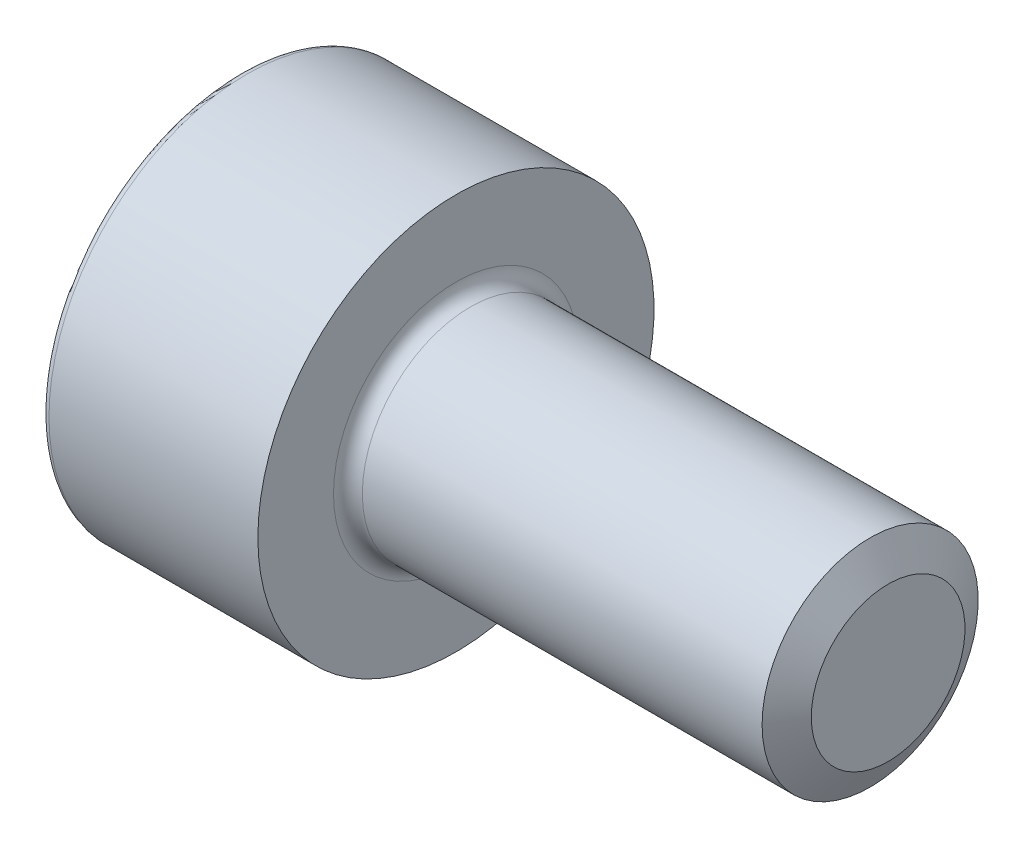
ISO-10303-21;
HEADER;
FILE_DESCRIPTION(('STEP AP214'),'2;1');
FILE_NAME('part.step','',(''),(''),'','','');
FILE_SCHEMA(('AUTOMOTIVE_DESIGN { 1 0 10303 214 1 1 1 1 }'));
ENDSEC;
DATA;
#1=APPLICATION_CONTEXT('core data for automotive mechanical design processes');
#2=APPLICATION_PROTOCOL_DEFINITION('international standard','automotive_design',2000,#1);
#3=PRODUCT_CONTEXT('',#1,'mechanical');
#4=PRODUCT('Part','Part','',(#3));
#5=PRODUCT_RELATED_PRODUCT_CATEGORY('part','',(#4));
#6=PRODUCT_DEFINITION_FORMATION('','',#4);
#7=PRODUCT_DEFINITION_CONTEXT('part definition',#1,'design');
#8=PRODUCT_DEFINITION('design','',#6,#7);
#9=PRODUCT_DEFINITION_SHAPE('','',#8);
#10=(LENGTH_UNIT() NAMED_UNIT(*) SI_UNIT(.MILLI.,.METRE.));
#11=(NAMED_UNIT(*) PLANE_ANGLE_UNIT() SI_UNIT($,.RADIAN.));
#12=(NAMED_UNIT(*) SI_UNIT($,.STERADIAN.) SOLID_ANGLE_UNIT());
#13=UNCERTAINTY_MEASURE_WITH_UNIT(LENGTH_MEASURE(1.E-05),#10,'distance_accuracy_value','');
#14=(GEOMETRIC_REPRESENTATION_CONTEXT(3) GLOBAL_UNCERTAINTY_ASSIGNED_CONTEXT((#13)) GLOBAL_UNIT_ASSIGNED_CONTEXT((#10,
#11,#12)) REPRESENTATION_CONTEXT('',''));
#15=CARTESIAN_POINT('',(0.,0.,0.));
#16=DIRECTION('',(0.,0.,1.));
#17=DIRECTION('',(1.,0.,0.));
#18=AXIS2_PLACEMENT_3D('',#15,#16,#17);
#19=CARTESIAN_POINT('',(9.,1.5,0.));
#20=DIRECTION('',(-1.,0.,0.));
#21=DIRECTION('',(0.,0.,1.));
#22=AXIS2_PLACEMENT_3D('',#19,#20,#21);
#23=PLANE('',#22);
#24=CARTESIAN_POINT('',(9.,0.,0.));
#25=DIRECTION('',(-1.,0.,0.));
#26=DIRECTION('',(0.,0.,1.));
#27=AXIS2_PLACEMENT_3D('',#24,#25,#26);
#28=CIRCLE('',#27,1.067);
#29=CARTESIAN_POINT('',(9.,0.,1.067));
#30=VERTEX_POINT('',#29);
#31=EDGE_CURVE('E184',#30,#30,#28,.T.);
#32=ORIENTED_EDGE('',*,*,#31,.F.);
#33=EDGE_LOOP('',(#32));
#34=FACE_BOUND('',#33,.T.);
#35=ADVANCED_FACE('F17',(#34),#23,.F.);
#36=CARTESIAN_POINT('',(1.3,-1.24274645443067,0.7175));
#37=DIRECTION('',(1.,0.,0.));
#38=DIRECTION('',(0.,1.,0.));
#39=AXIS2_PLACEMENT_3D('',#36,#37,#38);
#40=PLANE('',#39);
#41=DIRECTION('',(0.,0.866025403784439,0.5));
#42=VECTOR('',#41,1.);
#43=CARTESIAN_POINT('',(1.3,-1.24274645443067,0.7175));
#44=LINE('',#43,#42);
#45=CARTESIAN_POINT('',(1.3,-1.24274645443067,0.7175));
#46=VERTEX_POINT('',#45);
#47=CARTESIAN_POINT('',(1.3,0.,1.435));
#48=VERTEX_POINT('',#47);
#49=EDGE_CURVE('E96',#46,#48,#44,.T.);
#50=ORIENTED_EDGE('',*,*,#49,.T.);
#51=DIRECTION('',(0.,0.866025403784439,-0.5));
#52=VECTOR('',#51,1.);
#53=CARTESIAN_POINT('',(1.3,0.,1.435));
#54=LINE('',#53,#52);
#55=CARTESIAN_POINT('',(1.3,1.24274645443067,0.7175));
#56=VERTEX_POINT('',#55);
#57=EDGE_CURVE('E11',#48,#56,#54,.T.);
#58=ORIENTED_EDGE('',*,*,#57,.T.);
#59=DIRECTION('',(0.,0.,-1.));
#60=VECTOR('',#59,1.);
#61=CARTESIAN_POINT('',(1.3,1.24274645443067,0.7175));
#62=LINE('',#61,#60);
#63=CARTESIAN_POINT('',(1.3,1.24274645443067,-0.7175));
#64=VERTEX_POINT('',#63);
#65=EDGE_CURVE('E44',#56,#64,#62,.T.);
#66=ORIENTED_EDGE('',*,*,#65,.T.);
#67=DIRECTION('',(0.,-0.866025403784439,-0.5));
#68=VECTOR('',#67,1.);
#69=CARTESIAN_POINT('',(1.3,1.24274645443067,-0.7175));
#70=LINE('',#69,#68);
#71=CARTESIAN_POINT('',(1.3,0.,-1.435));
#72=VERTEX_POINT('',#71);
#73=EDGE_CURVE('E134',#64,#72,#70,.T.);
#74=ORIENTED_EDGE('',*,*,#73,.T.);
#75=DIRECTION('',(0.,-0.866025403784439,0.5));
#76=VECTOR('',#75,1.);
#77=CARTESIAN_POINT('',(1.3,0.,-1.435));
#78=LINE('',#77,#76);
#79=CARTESIAN_POINT('',(1.3,-1.24274645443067,-0.7175));
#80=VERTEX_POINT('',#79);
#81=EDGE_CURVE('E154',#72,#80,#78,.T.);
#82=ORIENTED_EDGE('',*,*,#81,.T.);
#83=DIRECTION('',(0.,0.,1.));
#84=VECTOR('',#83,1.);
#85=CARTESIAN_POINT('',(1.3,-1.24274645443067,-0.7175));
#86=LINE('',#85,#84);
#87=EDGE_CURVE('E146',#80,#46,#86,.T.);
#88=ORIENTED_EDGE('',*,*,#87,.T.);
#89=EDGE_LOOP('',(#50,#58,#66,#74,#82,#88));
#90=FACE_BOUND('',#89,.T.);
#91=ADVANCED_FACE('F221',(#90),#40,.F.);
#92=CARTESIAN_POINT('',(1.3,0.,1.435));
#93=DIRECTION('',(0.,0.5,0.866025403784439));
#94=DIRECTION('',(1.,0.,0.));
#95=AXIS2_PLACEMENT_3D('',#92,#93,#94);
#96=PLANE('',#95);
#97=DIRECTION('',(0.,0.866025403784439,-0.5));
#98=VECTOR('',#97,1.);
#99=CARTESIAN_POINT('',(0.,0.,1.435));
#100=LINE('',#99,#98);
#101=CARTESIAN_POINT('',(0.,0.,1.435));
#102=VERTEX_POINT('',#101);
#103=CARTESIAN_POINT('',(0.,1.24274645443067,0.7175));
#104=VERTEX_POINT('',#103);
#105=EDGE_CURVE('E92',#102,#104,#100,.T.);
#106=ORIENTED_EDGE('',*,*,#105,.T.);
#107=DIRECTION('',(-1.,0.,0.));
#108=VECTOR('',#107,1.);
#109=CARTESIAN_POINT('',(1.3,1.24274645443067,0.7175));
#110=LINE('',#109,#108);
#111=EDGE_CURVE('E25',#56,#104,#110,.T.);
#112=ORIENTED_EDGE('',*,*,#111,.F.);
#113=ORIENTED_EDGE('',*,*,#57,.F.);
#114=DIRECTION('',(-1.,0.,0.));
#115=VECTOR('',#114,1.);
#116=CARTESIAN_POINT('',(1.3,0.,1.435));
#117=LINE('',#116,#115);
#118=EDGE_CURVE('E88',#48,#102,#117,.T.);
#119=ORIENTED_EDGE('',*,*,#118,.T.);
#120=EDGE_LOOP('',(#106,#112,#113,#119));
#121=FACE_BOUND('',#120,.T.);
#122=ADVANCED_FACE('F90',(#121),#96,.F.);
#123=CARTESIAN_POINT('',(1.3,1.24274645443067,0.7175));
#124=DIRECTION('',(0.,1.,0.));
#125=DIRECTION('',(1.,0.,0.));
#126=AXIS2_PLACEMENT_3D('',#123,#124,#125);
#127=PLANE('',#126);
#128=DIRECTION('',(0.,0.,-1.));
#129=VECTOR('',#128,1.);
#130=CARTESIAN_POINT('',(0.,1.24274645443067,0.7175));
#131=LINE('',#130,#129);
#132=CARTESIAN_POINT('',(0.,1.24274645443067,-0.7175));
#133=VERTEX_POINT('',#132);
#134=EDGE_CURVE('E97',#104,#133,#131,.T.);
#135=ORIENTED_EDGE('',*,*,#134,.T.);
#136=DIRECTION('',(-1.,0.,0.));
#137=VECTOR('',#136,1.);
#138=CARTESIAN_POINT('',(1.3,1.24274645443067,-0.7175));
#139=LINE('',#138,#137);
#140=EDGE_CURVE('E137',#64,#133,#139,.T.);
#141=ORIENTED_EDGE('',*,*,#140,.F.);
#142=ORIENTED_EDGE('',*,*,#65,.F.);
#143=ORIENTED_EDGE('',*,*,#111,.T.);
#144=EDGE_LOOP('',(#135,#141,#142,#143));
#145=FACE_BOUND('',#144,.T.);
#146=ADVANCED_FACE('F231',(#145),#127,.F.);
#147=CARTESIAN_POINT('',(1.3,1.24274645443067,-0.7175));
#148=DIRECTION('',(0.,0.5,-0.866025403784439));
#149=DIRECTION('',(-1.,0.,0.));
#150=AXIS2_PLACEMENT_3D('',#147,#148,#149);
#151=PLANE('',#150);
#152=DIRECTION('',(0.,-0.866025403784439,-0.5));
#153=VECTOR('',#152,1.);
#154=CARTESIAN_POINT('',(0.,1.24274645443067,-0.7175));
#155=LINE('',#154,#153);
#156=CARTESIAN_POINT('',(0.,0.,-1.435));
#157=VERTEX_POINT('',#156);
#158=EDGE_CURVE('E133',#133,#157,#155,.T.);
#159=ORIENTED_EDGE('',*,*,#158,.T.);
#160=DIRECTION('',(-1.,0.,0.));
#161=VECTOR('',#160,1.);
#162=CARTESIAN_POINT('',(1.3,0.,-1.435));
#163=LINE('',#162,#161);
#164=EDGE_CURVE('E138',#72,#157,#163,.T.);
#165=ORIENTED_EDGE('',*,*,#164,.F.);
#166=ORIENTED_EDGE('',*,*,#73,.F.);
#167=ORIENTED_EDGE('',*,*,#140,.T.);
#168=EDGE_LOOP('',(#159,#165,#166,#167));
#169=FACE_BOUND('',#168,.T.);
#170=ADVANCED_FACE('F235',(#169),#151,.F.);
#171=CARTESIAN_POINT('',(1.3,0.,-1.435));
#172=DIRECTION('',(0.,-0.5,-0.866025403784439));
#173=DIRECTION('',(0.,-0.866025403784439,0.5));
#174=AXIS2_PLACEMENT_3D('',#171,#172,#173);
#175=PLANE('',#174);
#176=DIRECTION('',(0.,-0.866025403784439,0.5));
#177=VECTOR('',#176,1.);
#178=CARTESIAN_POINT('',(0.,0.,-1.435));
#179=LINE('',#178,#177);
#180=CARTESIAN_POINT('',(0.,-1.24274645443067,-0.7175));
#181=VERTEX_POINT('',#180);
#182=EDGE_CURVE('E129',#157,#181,#179,.T.);
#183=ORIENTED_EDGE('',*,*,#182,.T.);
#184=DIRECTION('',(-1.,0.,0.));
#185=VECTOR('',#184,1.);
#186=CARTESIAN_POINT('',(1.3,-1.24274645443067,-0.7175));
#187=LINE('',#186,#185);
#188=EDGE_CURVE('E151',#80,#181,#187,.T.);
#189=ORIENTED_EDGE('',*,*,#188,.F.);
#190=ORIENTED_EDGE('',*,*,#81,.F.);
#191=ORIENTED_EDGE('',*,*,#164,.T.);
#192=EDGE_LOOP('',(#183,#189,#190,#191));
#193=FACE_BOUND('',#192,.T.);
#194=ADVANCED_FACE('F239',(#193),#175,.F.);
#195=CARTESIAN_POINT('',(1.3,-1.24274645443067,-0.7175));
#196=DIRECTION('',(0.,-1.,0.));
#197=DIRECTION('',(0.,0.,-1.));
#198=AXIS2_PLACEMENT_3D('',#195,#196,#197);
#199=PLANE('',#198);
#200=DIRECTION('',(0.,0.,1.));
#201=VECTOR('',#200,1.);
#202=CARTESIAN_POINT('',(0.,-1.24274645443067,-0.7175));
#203=LINE('',#202,#201);
#204=CARTESIAN_POINT('',(0.,-1.24274645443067,0.7175));
#205=VERTEX_POINT('',#204);
#206=EDGE_CURVE('E108',#181,#205,#203,.T.);
#207=ORIENTED_EDGE('',*,*,#206,.T.);
#208=DIRECTION('',(-1.,0.,0.));
#209=VECTOR('',#208,1.);
#210=CARTESIAN_POINT('',(1.3,-1.24274645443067,0.7175));
#211=LINE('',#210,#209);
#212=EDGE_CURVE('E103',#46,#205,#211,.T.);
#213=ORIENTED_EDGE('',*,*,#212,.F.);
#214=ORIENTED_EDGE('',*,*,#87,.F.);
#215=ORIENTED_EDGE('',*,*,#188,.T.);
#216=EDGE_LOOP('',(#207,#213,#214,#215));
#217=FACE_BOUND('',#216,.T.);
#218=ADVANCED_FACE('F243',(#217),#199,.F.);
#219=CARTESIAN_POINT('',(1.3,-1.24274645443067,0.7175));
#220=DIRECTION('',(0.,-0.5,0.866025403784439));
#221=DIRECTION('',(-1.,0.,0.));
#222=AXIS2_PLACEMENT_3D('',#219,#220,#221);
#223=PLANE('',#222);
#224=DIRECTION('',(0.,0.866025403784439,0.5));
#225=VECTOR('',#224,1.);
#226=CARTESIAN_POINT('',(0.,-1.24274645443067,0.7175));
#227=LINE('',#226,#225);
#228=EDGE_CURVE('E100',#205,#102,#227,.T.);
#229=ORIENTED_EDGE('',*,*,#228,.T.);
#230=ORIENTED_EDGE('',*,*,#118,.F.);
#231=ORIENTED_EDGE('',*,*,#49,.F.);
#232=ORIENTED_EDGE('',*,*,#212,.T.);
#233=EDGE_LOOP('',(#229,#230,#231,#232));
#234=FACE_BOUND('',#233,.T.);
#235=ADVANCED_FACE('F101',(#234),#223,.F.);
#236=CARTESIAN_POINT('',(3.,2.75,0.));
#237=DIRECTION('',(-1.,0.,0.));
#238=DIRECTION('',(0.,0.,1.));
#239=AXIS2_PLACEMENT_3D('',#236,#237,#238);
#240=PLANE('',#239);
#241=CARTESIAN_POINT('',(3.,0.,0.));
#242=DIRECTION('',(-1.,0.,0.));
#243=DIRECTION('',(0.,0.,1.));
#244=AXIS2_PLACEMENT_3D('',#241,#242,#243);
#245=CIRCLE('',#244,1.7);
#246=CARTESIAN_POINT('',(3.,0.,1.7));
#247=VERTEX_POINT('',#246);
#248=EDGE_CURVE('E169',#247,#247,#245,.T.);
#249=ORIENTED_EDGE('',*,*,#248,.T.);
#250=EDGE_LOOP('',(#249));
#251=FACE_BOUND('',#250,.T.);
#252=CARTESIAN_POINT('',(3.,0.,0.));
#253=DIRECTION('',(-1.,0.,0.));
#254=DIRECTION('',(0.,0.,1.));
#255=AXIS2_PLACEMENT_3D('',#252,#253,#254);
#256=CIRCLE('',#255,2.75);
#257=CARTESIAN_POINT('',(3.,0.,2.75));
#258=VERTEX_POINT('',#257);
#259=EDGE_CURVE('E116',#258,#258,#256,.T.);
#260=ORIENTED_EDGE('',*,*,#259,.F.);
#261=EDGE_LOOP('',(#260));
#262=FACE_BOUND('',#261,.T.);
#263=ADVANCED_FACE('F247',(#251,#262),#240,.F.);
#264=CARTESIAN_POINT('',(0.,0.,0.));
#265=DIRECTION('',(1.,0.,0.));
#266=DIRECTION('',(0.,1.,0.));
#267=AXIS2_PLACEMENT_3D('',#264,#265,#266);
#268=PLANE('',#267);
#269=ORIENTED_EDGE('',*,*,#105,.F.);
#270=ORIENTED_EDGE('',*,*,#228,.F.);
#271=ORIENTED_EDGE('',*,*,#206,.F.);
#272=ORIENTED_EDGE('',*,*,#182,.F.);
#273=ORIENTED_EDGE('',*,*,#158,.F.);
#274=ORIENTED_EDGE('',*,*,#134,.F.);
#275=EDGE_LOOP('',(#269,#270,#271,#272,#273,#274));
#276=FACE_BOUND('',#275,.T.);
#277=CARTESIAN_POINT('',(0.,0.,0.));
#278=DIRECTION('',(-1.,0.,0.));
#279=DIRECTION('',(0.,0.,-1.));
#280=AXIS2_PLACEMENT_3D('',#277,#278,#279);
#281=CIRCLE('',#280,2.65);
#282=CARTESIAN_POINT('',(0.,0.,-2.65));
#283=VERTEX_POINT('',#282);
#284=EDGE_CURVE('E199',#283,#283,#281,.T.);
#285=ORIENTED_EDGE('',*,*,#284,.T.);
#286=EDGE_LOOP('',(#285));
#287=FACE_BOUND('',#286,.T.);
#288=ADVANCED_FACE('F111',(#276,#287),#268,.F.);
#289=CARTESIAN_POINT('',(0.,0.,0.));
#290=DIRECTION('',(-1.,0.,0.));
#291=DIRECTION('',(0.,0.,1.));
#292=AXIS2_PLACEMENT_3D('',#289,#290,#291);
#293=CYLINDRICAL_SURFACE('',#292,1.5);
#294=CARTESIAN_POINT('',(3.2,0.,0.));
#295=DIRECTION('',(-1.,0.,0.));
#296=DIRECTION('',(0.,0.,1.));
#297=AXIS2_PLACEMENT_3D('',#294,#295,#296);
#298=CIRCLE('',#297,1.5);
#299=CARTESIAN_POINT('',(3.2,0.,1.5));
#300=VERTEX_POINT('',#299);
#301=EDGE_CURVE('E123',#300,#300,#298,.T.);
#302=ORIENTED_EDGE('',*,*,#301,.F.);
#303=EDGE_LOOP('',(#302));
#304=FACE_BOUND('',#303,.T.);
#305=CARTESIAN_POINT('',(8.75000733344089,0.,0.));
#306=DIRECTION('',(-1.,0.,0.));
#307=DIRECTION('',(0.,0.,1.));
#308=AXIS2_PLACEMENT_3D('',#305,#306,#307);
#309=CIRCLE('',#308,1.5);
#310=CARTESIAN_POINT('',(8.75000733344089,0.,1.5));
#311=VERTEX_POINT('',#310);
#312=EDGE_CURVE('E178',#311,#311,#309,.T.);
#313=ORIENTED_EDGE('',*,*,#312,.T.);
#314=EDGE_LOOP('',(#313));
#315=FACE_BOUND('',#314,.T.);
#316=ADVANCED_FACE('F250',(#304,#315),#293,.T.);
#317=CARTESIAN_POINT('',(0.,0.,0.));
#318=DIRECTION('',(-1.,0.,0.));
#319=DIRECTION('',(0.,0.,1.));
#320=AXIS2_PLACEMENT_3D('',#317,#318,#319);
#321=CYLINDRICAL_SURFACE('',#320,2.75);
#322=CARTESIAN_POINT('',(0.1,0.,0.));
#323=DIRECTION('',(1.,0.,0.));
#324=DIRECTION('',(0.,0.,-1.));
#325=AXIS2_PLACEMENT_3D('',#322,#323,#324);
#326=CIRCLE('',#325,2.75);
#327=CARTESIAN_POINT('',(0.1,0.,-2.75));
#328=VERTEX_POINT('',#327);
#329=EDGE_CURVE('E191',#328,#328,#326,.T.);
#330=ORIENTED_EDGE('',*,*,#329,.T.);
#331=EDGE_LOOP('',(#330));
#332=FACE_BOUND('',#331,.T.);
#333=ORIENTED_EDGE('',*,*,#259,.T.);
#334=EDGE_LOOP('',(#333));
#335=FACE_BOUND('',#334,.T.);
#336=ADVANCED_FACE('F256',(#332,#335),#321,.T.);
#337=CARTESIAN_POINT('',(3.2,0.,0.));
#338=DIRECTION('',(-1.,0.,0.));
#339=DIRECTION('',(0.,0.,1.));
#340=AXIS2_PLACEMENT_3D('',#337,#338,#339);
#341=TOROIDAL_SURFACE('',#340,1.7,0.2);
#342=ORIENTED_EDGE('',*,*,#301,.T.);
#343=EDGE_LOOP('',(#342));
#344=FACE_BOUND('',#343,.T.);
#345=ORIENTED_EDGE('',*,*,#248,.F.);
#346=EDGE_LOOP('',(#345));
#347=FACE_BOUND('',#346,.T.);
#348=ADVANCED_FACE('F215',(#344,#347),#341,.F.);
#349=CARTESIAN_POINT('',(8.75000733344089,0.,0.));
#350=DIRECTION('',(-1.,0.,0.));
#351=DIRECTION('',(0.,0.,1.));
#352=AXIS2_PLACEMENT_3D('',#349,#350,#351);
#353=CONICAL_SURFACE('',#352,1.5,1.0471975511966);
#354=ORIENTED_EDGE('',*,*,#312,.F.);
#355=EDGE_LOOP('',(#354));
#356=FACE_BOUND('',#355,.T.);
#357=ORIENTED_EDGE('',*,*,#31,.T.);
#358=EDGE_LOOP('',(#357));
#359=FACE_BOUND('',#358,.T.);
#360=ADVANCED_FACE('F208',(#356,#359),#353,.T.);
#361=CARTESIAN_POINT('',(0.1,0.,0.));
#362=DIRECTION('',(1.,0.,0.));
#363=DIRECTION('',(0.,0.,-1.));
#364=AXIS2_PLACEMENT_3D('',#361,#362,#363);
#365=TOROIDAL_SURFACE('',#364,2.65,0.1);
#366=ORIENTED_EDGE('',*,*,#329,.F.);
#367=EDGE_LOOP('',(#366));
#368=FACE_BOUND('',#367,.T.);
#369=ORIENTED_EDGE('',*,*,#284,.F.);
#370=EDGE_LOOP('',(#369));
#371=FACE_BOUND('',#370,.T.);
#372=ADVANCED_FACE('F206',(#368,#371),#365,.T.);
#373=CLOSED_SHELL('',(#35,#91,#122,#146,#170,#194,#218,#235,#263,#288,#316,#336,#348,#360,#372));
#374=MANIFOLD_SOLID_BREP('B1',#373);
#375=ADVANCED_BREP_SHAPE_REPRESENTATION('',(#18,#374),#14);
#376=SHAPE_DEFINITION_REPRESENTATION(#9,#375);
ENDSEC;
END-ISO-10303-21;
